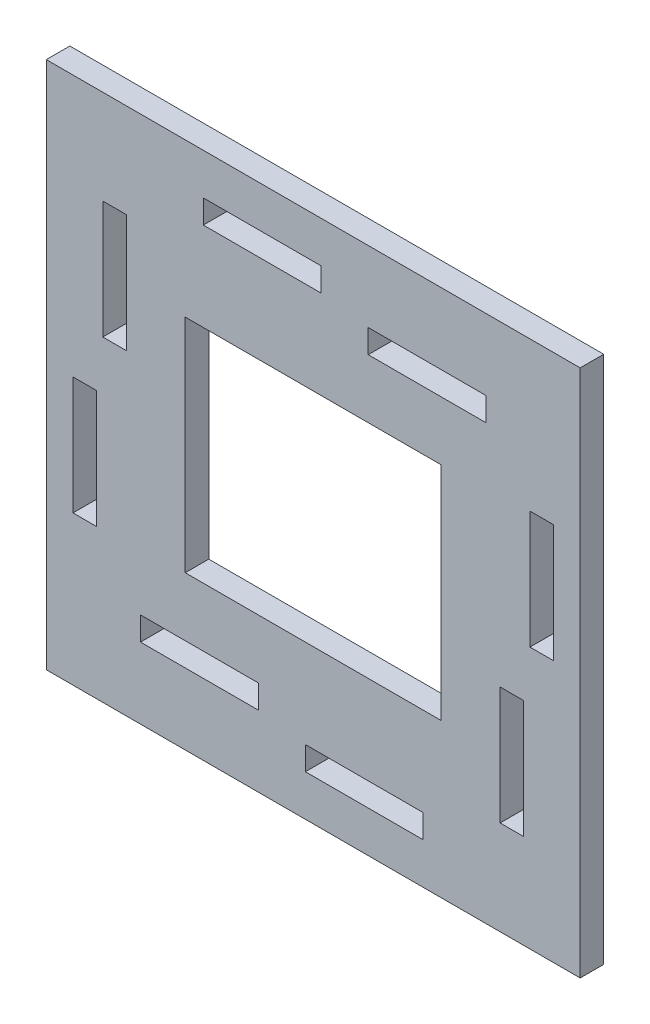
ISO-10303-21;
HEADER;
FILE_DESCRIPTION(('STEP AP214'),'2;1');
FILE_NAME('part.step','',(''),(''),'','','');
FILE_SCHEMA(('AUTOMOTIVE_DESIGN { 1 0 10303 214 1 1 1 1 }'));
ENDSEC;
DATA;
#1=APPLICATION_CONTEXT('core data for automotive mechanical design processes');
#2=APPLICATION_PROTOCOL_DEFINITION('international standard','automotive_design',2000,#1);
#3=PRODUCT_CONTEXT('',#1,'mechanical');
#4=PRODUCT('Part','Part','',(#3));
#5=PRODUCT_RELATED_PRODUCT_CATEGORY('part','',(#4));
#6=PRODUCT_DEFINITION_FORMATION('','',#4);
#7=PRODUCT_DEFINITION_CONTEXT('part definition',#1,'design');
#8=PRODUCT_DEFINITION('design','',#6,#7);
#9=PRODUCT_DEFINITION_SHAPE('','',#8);
#10=(LENGTH_UNIT() NAMED_UNIT(*) SI_UNIT(.MILLI.,.METRE.));
#11=(NAMED_UNIT(*) PLANE_ANGLE_UNIT() SI_UNIT($,.RADIAN.));
#12=(NAMED_UNIT(*) SI_UNIT($,.STERADIAN.) SOLID_ANGLE_UNIT());
#13=UNCERTAINTY_MEASURE_WITH_UNIT(LENGTH_MEASURE(1.E-05),#10,'distance_accuracy_value','');
#14=(GEOMETRIC_REPRESENTATION_CONTEXT(3) GLOBAL_UNCERTAINTY_ASSIGNED_CONTEXT((#13)) GLOBAL_UNIT_ASSIGNED_CONTEXT((#10,
#11,#12)) REPRESENTATION_CONTEXT('',''));
#15=CARTESIAN_POINT('',(0.,0.,0.));
#16=DIRECTION('',(0.,0.,1.));
#17=DIRECTION('',(1.,0.,0.));
#18=AXIS2_PLACEMENT_3D('',#15,#16,#17);
#19=CARTESIAN_POINT('',(0.,0.,3.));
#20=DIRECTION('',(0.,0.,-1.));
#21=DIRECTION('',(-1.,0.,0.));
#22=AXIS2_PLACEMENT_3D('',#19,#20,#21);
#23=PLANE('',#22);
#24=DIRECTION('',(0.,1.,0.));
#25=VECTOR('',#24,1.);
#26=CARTESIAN_POINT('',(-27.6,0.35,3.));
#27=LINE('',#26,#25);
#28=CARTESIAN_POINT('',(-27.6,-14.65,3.));
#29=VERTEX_POINT('',#28);
#30=CARTESIAN_POINT('',(-27.6,0.35,3.));
#31=VERTEX_POINT('',#30);
#32=EDGE_CURVE('E349',#29,#31,#27,.T.);
#33=ORIENTED_EDGE('',*,*,#32,.F.);
#34=DIRECTION('',(1.,0.,0.));
#35=VECTOR('',#34,1.);
#36=CARTESIAN_POINT('',(-30.6,-14.65,3.));
#37=LINE('',#36,#35);
#38=CARTESIAN_POINT('',(-30.6,-14.65,3.));
#39=VERTEX_POINT('',#38);
#40=EDGE_CURVE('E360',#39,#29,#37,.T.);
#41=ORIENTED_EDGE('',*,*,#40,.F.);
#42=DIRECTION('',(0.,-1.,0.));
#43=VECTOR('',#42,1.);
#44=CARTESIAN_POINT('',(-30.6,0.35,3.));
#45=LINE('',#44,#43);
#46=CARTESIAN_POINT('',(-30.6,0.35,3.));
#47=VERTEX_POINT('',#46);
#48=EDGE_CURVE('E356',#47,#39,#45,.T.);
#49=ORIENTED_EDGE('',*,*,#48,.F.);
#50=DIRECTION('',(-1.,0.,0.));
#51=VECTOR('',#50,1.);
#52=CARTESIAN_POINT('',(-30.6,0.35,3.));
#53=LINE('',#52,#51);
#54=EDGE_CURVE('E352',#31,#47,#53,.T.);
#55=ORIENTED_EDGE('',*,*,#54,.F.);
#56=EDGE_LOOP('',(#33,#41,#49,#55));
#57=FACE_BOUND('',#56,.T.);
#58=DIRECTION('',(0.,-1.,0.));
#59=VECTOR('',#58,1.);
#60=CARTESIAN_POINT('',(-0.999999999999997,-25.4,3.));
#61=LINE('',#60,#59);
#62=CARTESIAN_POINT('',(-0.999999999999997,-25.4,3.));
#63=VERTEX_POINT('',#62);
#64=CARTESIAN_POINT('',(-0.999999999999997,-28.4,3.));
#65=VERTEX_POINT('',#64);
#66=EDGE_CURVE('E435',#63,#65,#61,.T.);
#67=ORIENTED_EDGE('',*,*,#66,.F.);
#68=DIRECTION('',(-1.,0.,0.));
#69=VECTOR('',#68,1.);
#70=CARTESIAN_POINT('',(14.,-25.4,3.));
#71=LINE('',#70,#69);
#72=CARTESIAN_POINT('',(14.,-25.4,3.));
#73=VERTEX_POINT('',#72);
#74=EDGE_CURVE('E446',#73,#63,#71,.T.);
#75=ORIENTED_EDGE('',*,*,#74,.F.);
#76=DIRECTION('',(0.,1.,0.));
#77=VECTOR('',#76,1.);
#78=CARTESIAN_POINT('',(14.,-25.4,3.));
#79=LINE('',#78,#77);
#80=CARTESIAN_POINT('',(14.,-28.4,3.));
#81=VERTEX_POINT('',#80);
#82=EDGE_CURVE('E442',#81,#73,#79,.T.);
#83=ORIENTED_EDGE('',*,*,#82,.F.);
#84=DIRECTION('',(1.,0.,0.));
#85=VECTOR('',#84,1.);
#86=CARTESIAN_POINT('',(14.,-28.4,3.));
#87=LINE('',#86,#85);
#88=EDGE_CURVE('E438',#65,#81,#87,.T.);
#89=ORIENTED_EDGE('',*,*,#88,.F.);
#90=EDGE_LOOP('',(#67,#75,#83,#89));
#91=FACE_BOUND('',#90,.T.);
#92=DIRECTION('',(0.,1.,0.));
#93=VECTOR('',#92,1.);
#94=CARTESIAN_POINT('',(30.6,14.65,3.));
#95=LINE('',#94,#93);
#96=CARTESIAN_POINT('',(30.6,-0.35,3.));
#97=VERTEX_POINT('',#96);
#98=CARTESIAN_POINT('',(30.6,14.65,3.));
#99=VERTEX_POINT('',#98);
#100=EDGE_CURVE('E521',#97,#99,#95,.T.);
#101=ORIENTED_EDGE('',*,*,#100,.F.);
#102=DIRECTION('',(1.,0.,0.));
#103=VECTOR('',#102,1.);
#104=CARTESIAN_POINT('',(27.6,-0.35,3.));
#105=LINE('',#104,#103);
#106=CARTESIAN_POINT('',(27.6,-0.35,3.));
#107=VERTEX_POINT('',#106);
#108=EDGE_CURVE('E532',#107,#97,#105,.T.);
#109=ORIENTED_EDGE('',*,*,#108,.F.);
#110=DIRECTION('',(0.,-1.,0.));
#111=VECTOR('',#110,1.);
#112=CARTESIAN_POINT('',(27.6,14.65,3.));
#113=LINE('',#112,#111);
#114=CARTESIAN_POINT('',(27.6,14.65,3.));
#115=VERTEX_POINT('',#114);
#116=EDGE_CURVE('E528',#115,#107,#113,.T.);
#117=ORIENTED_EDGE('',*,*,#116,.F.);
#118=DIRECTION('',(-1.,0.,0.));
#119=VECTOR('',#118,1.);
#120=CARTESIAN_POINT('',(27.6,14.65,3.));
#121=LINE('',#120,#119);
#122=EDGE_CURVE('E524',#99,#115,#121,.T.);
#123=ORIENTED_EDGE('',*,*,#122,.F.);
#124=EDGE_LOOP('',(#101,#109,#117,#123));
#125=FACE_BOUND('',#124,.T.);
#126=DIRECTION('',(0.,1.,0.));
#127=VECTOR('',#126,1.);
#128=CARTESIAN_POINT('',(22.,21.6,3.));
#129=LINE('',#128,#127);
#130=CARTESIAN_POINT('',(22.,21.6,3.));
#131=VERTEX_POINT('',#130);
#132=CARTESIAN_POINT('',(22.,24.6,3.));
#133=VERTEX_POINT('',#132);
#134=EDGE_CURVE('E607',#131,#133,#129,.T.);
#135=ORIENTED_EDGE('',*,*,#134,.F.);
#136=DIRECTION('',(1.,0.,0.));
#137=VECTOR('',#136,1.);
#138=CARTESIAN_POINT('',(7.,21.6,3.));
#139=LINE('',#138,#137);
#140=CARTESIAN_POINT('',(7.,21.6,3.));
#141=VERTEX_POINT('',#140);
#142=EDGE_CURVE('E618',#141,#131,#139,.T.);
#143=ORIENTED_EDGE('',*,*,#142,.F.);
#144=DIRECTION('',(0.,-1.,0.));
#145=VECTOR('',#144,1.);
#146=CARTESIAN_POINT('',(7.,21.6,3.));
#147=LINE('',#146,#145);
#148=CARTESIAN_POINT('',(7.,24.6,3.));
#149=VERTEX_POINT('',#148);
#150=EDGE_CURVE('E614',#149,#141,#147,.T.);
#151=ORIENTED_EDGE('',*,*,#150,.F.);
#152=DIRECTION('',(-1.,0.,0.));
#153=VECTOR('',#152,1.);
#154=CARTESIAN_POINT('',(7.,24.6,3.));
#155=LINE('',#154,#153);
#156=EDGE_CURVE('E610',#133,#149,#155,.T.);
#157=ORIENTED_EDGE('',*,*,#156,.F.);
#158=EDGE_LOOP('',(#135,#143,#151,#157));
#159=FACE_BOUND('',#158,.T.);
#160=DIRECTION('',(0.,1.,0.));
#161=VECTOR('',#160,1.);
#162=CARTESIAN_POINT('',(34.,-33.65,3.));
#163=LINE('',#162,#161);
#164=CARTESIAN_POINT('',(34.,-33.65,3.));
#165=VERTEX_POINT('',#164);
#166=CARTESIAN_POINT('',(34.,33.65,3.));
#167=VERTEX_POINT('',#166);
#168=EDGE_CURVE('E693',#165,#167,#163,.T.);
#169=ORIENTED_EDGE('',*,*,#168,.T.);
#170=DIRECTION('',(-1.,0.,0.));
#171=VECTOR('',#170,1.);
#172=CARTESIAN_POINT('',(-34.,33.65,3.));
#173=LINE('',#172,#171);
#174=CARTESIAN_POINT('',(-34.,33.65,3.));
#175=VERTEX_POINT('',#174);
#176=EDGE_CURVE('E697',#167,#175,#173,.T.);
#177=ORIENTED_EDGE('',*,*,#176,.T.);
#178=DIRECTION('',(0.,-1.,0.));
#179=VECTOR('',#178,1.);
#180=CARTESIAN_POINT('',(-34.,-33.65,3.));
#181=LINE('',#180,#179);
#182=CARTESIAN_POINT('',(-34.,-33.65,3.));
#183=VERTEX_POINT('',#182);
#184=EDGE_CURVE('E701',#175,#183,#181,.T.);
#185=ORIENTED_EDGE('',*,*,#184,.T.);
#186=DIRECTION('',(1.,0.,0.));
#187=VECTOR('',#186,1.);
#188=CARTESIAN_POINT('',(-34.,-33.65,3.));
#189=LINE('',#188,#187);
#190=EDGE_CURVE('E704',#183,#165,#189,.T.);
#191=ORIENTED_EDGE('',*,*,#190,.T.);
#192=EDGE_LOOP('',(#169,#177,#185,#191));
#193=FACE_BOUND('',#192,.T.);
#194=DIRECTION('',(0.,1.,0.));
#195=VECTOR('',#194,1.);
#196=CARTESIAN_POINT('',(16.3,-14.1,3.));
#197=LINE('',#196,#195);
#198=CARTESIAN_POINT('',(16.3,-14.1,3.));
#199=VERTEX_POINT('',#198);
#200=CARTESIAN_POINT('',(16.3,14.1,3.));
#201=VERTEX_POINT('',#200);
#202=EDGE_CURVE('E650',#199,#201,#197,.T.);
#203=ORIENTED_EDGE('',*,*,#202,.F.);
#204=DIRECTION('',(1.,0.,0.));
#205=VECTOR('',#204,1.);
#206=CARTESIAN_POINT('',(-16.3,-14.1,3.));
#207=LINE('',#206,#205);
#208=CARTESIAN_POINT('',(-16.3,-14.1,3.));
#209=VERTEX_POINT('',#208);
#210=EDGE_CURVE('E661',#209,#199,#207,.T.);
#211=ORIENTED_EDGE('',*,*,#210,.F.);
#212=DIRECTION('',(0.,-1.,0.));
#213=VECTOR('',#212,1.);
#214=CARTESIAN_POINT('',(-16.3,-14.1,3.));
#215=LINE('',#214,#213);
#216=CARTESIAN_POINT('',(-16.3,14.1,3.));
#217=VERTEX_POINT('',#216);
#218=EDGE_CURVE('E657',#217,#209,#215,.T.);
#219=ORIENTED_EDGE('',*,*,#218,.F.);
#220=DIRECTION('',(-1.,0.,0.));
#221=VECTOR('',#220,1.);
#222=CARTESIAN_POINT('',(-16.3,14.1,3.));
#223=LINE('',#222,#221);
#224=EDGE_CURVE('E653',#201,#217,#223,.T.);
#225=ORIENTED_EDGE('',*,*,#224,.F.);
#226=EDGE_LOOP('',(#203,#211,#219,#225));
#227=FACE_BOUND('',#226,.T.);
#228=DIRECTION('',(0.,-1.,0.));
#229=VECTOR('',#228,1.);
#230=CARTESIAN_POINT('',(-14.,25.4,3.));
#231=LINE('',#230,#229);
#232=CARTESIAN_POINT('',(-14.,28.4,3.));
#233=VERTEX_POINT('',#232);
#234=CARTESIAN_POINT('',(-14.,25.4,3.));
#235=VERTEX_POINT('',#234);
#236=EDGE_CURVE('E564',#233,#235,#231,.T.);
#237=ORIENTED_EDGE('',*,*,#236,.F.);
#238=DIRECTION('',(-1.,0.,0.));
#239=VECTOR('',#238,1.);
#240=CARTESIAN_POINT('',(0.999999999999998,28.4,3.));
#241=LINE('',#240,#239);
#242=CARTESIAN_POINT('',(0.999999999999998,28.4,3.));
#243=VERTEX_POINT('',#242);
#244=EDGE_CURVE('E575',#243,#233,#241,.T.);
#245=ORIENTED_EDGE('',*,*,#244,.F.);
#246=DIRECTION('',(0.,1.,0.));
#247=VECTOR('',#246,1.);
#248=CARTESIAN_POINT('',(0.999999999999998,25.4,3.));
#249=LINE('',#248,#247);
#250=CARTESIAN_POINT('',(0.999999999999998,25.4,3.));
#251=VERTEX_POINT('',#250);
#252=EDGE_CURVE('E571',#251,#243,#249,.T.);
#253=ORIENTED_EDGE('',*,*,#252,.F.);
#254=DIRECTION('',(1.,0.,0.));
#255=VECTOR('',#254,1.);
#256=CARTESIAN_POINT('',(0.999999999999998,25.4,3.));
#257=LINE('',#256,#255);
#258=EDGE_CURVE('E567',#235,#251,#257,.T.);
#259=ORIENTED_EDGE('',*,*,#258,.F.);
#260=EDGE_LOOP('',(#237,#245,#253,#259));
#261=FACE_BOUND('',#260,.T.);
#262=DIRECTION('',(0.,1.,0.));
#263=VECTOR('',#262,1.);
#264=CARTESIAN_POINT('',(26.8,-6.65,3.));
#265=LINE('',#264,#263);
#266=CARTESIAN_POINT('',(26.8,-21.65,3.));
#267=VERTEX_POINT('',#266);
#268=CARTESIAN_POINT('',(26.8,-6.65,3.));
#269=VERTEX_POINT('',#268);
#270=EDGE_CURVE('E478',#267,#269,#265,.T.);
#271=ORIENTED_EDGE('',*,*,#270,.F.);
#272=DIRECTION('',(1.,0.,0.));
#273=VECTOR('',#272,1.);
#274=CARTESIAN_POINT('',(23.8,-21.65,3.));
#275=LINE('',#274,#273);
#276=CARTESIAN_POINT('',(23.8,-21.65,3.));
#277=VERTEX_POINT('',#276);
#278=EDGE_CURVE('E489',#277,#267,#275,.T.);
#279=ORIENTED_EDGE('',*,*,#278,.F.);
#280=DIRECTION('',(0.,-1.,0.));
#281=VECTOR('',#280,1.);
#282=CARTESIAN_POINT('',(23.8,-6.65,3.));
#283=LINE('',#282,#281);
#284=CARTESIAN_POINT('',(23.8,-6.65,3.));
#285=VERTEX_POINT('',#284);
#286=EDGE_CURVE('E485',#285,#277,#283,.T.);
#287=ORIENTED_EDGE('',*,*,#286,.F.);
#288=DIRECTION('',(-1.,0.,0.));
#289=VECTOR('',#288,1.);
#290=CARTESIAN_POINT('',(23.8,-6.65,3.));
#291=LINE('',#290,#289);
#292=EDGE_CURVE('E481',#269,#285,#291,.T.);
#293=ORIENTED_EDGE('',*,*,#292,.F.);
#294=EDGE_LOOP('',(#271,#279,#287,#293));
#295=FACE_BOUND('',#294,.T.);
#296=DIRECTION('',(0.,-1.,0.));
#297=VECTOR('',#296,1.);
#298=CARTESIAN_POINT('',(-22.,-21.6,3.));
#299=LINE('',#298,#297);
#300=CARTESIAN_POINT('',(-22.,-21.6,3.));
#301=VERTEX_POINT('',#300);
#302=CARTESIAN_POINT('',(-22.,-24.6,3.));
#303=VERTEX_POINT('',#302);
#304=EDGE_CURVE('E392',#301,#303,#299,.T.);
#305=ORIENTED_EDGE('',*,*,#304,.F.);
#306=DIRECTION('',(-1.,0.,0.));
#307=VECTOR('',#306,1.);
#308=CARTESIAN_POINT('',(-7.,-21.6,3.));
#309=LINE('',#308,#307);
#310=CARTESIAN_POINT('',(-7.,-21.6,3.));
#311=VERTEX_POINT('',#310);
#312=EDGE_CURVE('E403',#311,#301,#309,.T.);
#313=ORIENTED_EDGE('',*,*,#312,.F.);
#314=DIRECTION('',(0.,1.,0.));
#315=VECTOR('',#314,1.);
#316=CARTESIAN_POINT('',(-7.,-21.6,3.));
#317=LINE('',#316,#315);
#318=CARTESIAN_POINT('',(-7.,-24.6,3.));
#319=VERTEX_POINT('',#318);
#320=EDGE_CURVE('E399',#319,#311,#317,.T.);
#321=ORIENTED_EDGE('',*,*,#320,.F.);
#322=DIRECTION('',(1.,0.,0.));
#323=VECTOR('',#322,1.);
#324=CARTESIAN_POINT('',(-7.,-24.6,3.));
#325=LINE('',#324,#323);
#326=EDGE_CURVE('E395',#303,#319,#325,.T.);
#327=ORIENTED_EDGE('',*,*,#326,.F.);
#328=EDGE_LOOP('',(#305,#313,#321,#327));
#329=FACE_BOUND('',#328,.T.);
#330=DIRECTION('',(0.,-1.,0.));
#331=VECTOR('',#330,1.);
#332=CARTESIAN_POINT('',(-26.8,21.65,3.));
#333=LINE('',#332,#331);
#334=CARTESIAN_POINT('',(-26.8,21.65,3.));
#335=VERTEX_POINT('',#334);
#336=CARTESIAN_POINT('',(-26.8,6.65,3.));
#337=VERTEX_POINT('',#336);
#338=EDGE_CURVE('E301',#335,#337,#333,.T.);
#339=ORIENTED_EDGE('',*,*,#338,.F.);
#340=DIRECTION('',(-1.,0.,0.));
#341=VECTOR('',#340,1.);
#342=CARTESIAN_POINT('',(-23.8,21.65,3.));
#343=LINE('',#342,#341);
#344=CARTESIAN_POINT('',(-23.8,21.65,3.));
#345=VERTEX_POINT('',#344);
#346=EDGE_CURVE('E327',#345,#335,#343,.T.);
#347=ORIENTED_EDGE('',*,*,#346,.F.);
#348=DIRECTION('',(0.,1.,0.));
#349=VECTOR('',#348,1.);
#350=CARTESIAN_POINT('',(-23.8,21.65,3.));
#351=LINE('',#350,#349);
#352=CARTESIAN_POINT('',(-23.8,6.65,3.));
#353=VERTEX_POINT('',#352);
#354=EDGE_CURVE('E323',#353,#345,#351,.T.);
#355=ORIENTED_EDGE('',*,*,#354,.F.);
#356=DIRECTION('',(1.,0.,0.));
#357=VECTOR('',#356,1.);
#358=CARTESIAN_POINT('',(-23.8,6.65,3.));
#359=LINE('',#358,#357);
#360=EDGE_CURVE('E310',#337,#353,#359,.T.);
#361=ORIENTED_EDGE('',*,*,#360,.F.);
#362=EDGE_LOOP('',(#339,#347,#355,#361));
#363=FACE_BOUND('',#362,.T.);
#364=ADVANCED_FACE('F43',(#57,#91,#125,#159,#193,#227,#261,#295,#329,#363),#23,.F.);
#365=CARTESIAN_POINT('',(0.,0.,0.));
#366=DIRECTION('',(0.,0.,-1.));
#367=DIRECTION('',(-1.,0.,0.));
#368=AXIS2_PLACEMENT_3D('',#365,#366,#367);
#369=PLANE('',#368);
#370=DIRECTION('',(0.,1.,0.));
#371=VECTOR('',#370,1.);
#372=CARTESIAN_POINT('',(34.,-33.65,0.));
#373=LINE('',#372,#371);
#374=CARTESIAN_POINT('',(34.,-33.65,0.));
#375=VERTEX_POINT('',#374);
#376=CARTESIAN_POINT('',(34.,33.65,0.));
#377=VERTEX_POINT('',#376);
#378=EDGE_CURVE('E692',#375,#377,#373,.T.);
#379=ORIENTED_EDGE('',*,*,#378,.F.);
#380=DIRECTION('',(1.,0.,0.));
#381=VECTOR('',#380,1.);
#382=CARTESIAN_POINT('',(-34.,-33.65,0.));
#383=LINE('',#382,#381);
#384=CARTESIAN_POINT('',(-34.,-33.65,0.));
#385=VERTEX_POINT('',#384);
#386=EDGE_CURVE('E698',#385,#375,#383,.T.);
#387=ORIENTED_EDGE('',*,*,#386,.F.);
#388=DIRECTION('',(0.,-1.,0.));
#389=VECTOR('',#388,1.);
#390=CARTESIAN_POINT('',(-34.,-33.65,0.));
#391=LINE('',#390,#389);
#392=CARTESIAN_POINT('',(-34.,33.65,0.));
#393=VERTEX_POINT('',#392);
#394=EDGE_CURVE('E714',#393,#385,#391,.T.);
#395=ORIENTED_EDGE('',*,*,#394,.F.);
#396=DIRECTION('',(-1.,0.,0.));
#397=VECTOR('',#396,1.);
#398=CARTESIAN_POINT('',(-34.,33.65,0.));
#399=LINE('',#398,#397);
#400=EDGE_CURVE('E711',#377,#393,#399,.T.);
#401=ORIENTED_EDGE('',*,*,#400,.F.);
#402=EDGE_LOOP('',(#379,#387,#395,#401));
#403=FACE_BOUND('',#402,.T.);
#404=DIRECTION('',(1.,0.,0.));
#405=VECTOR('',#404,1.);
#406=CARTESIAN_POINT('',(-16.3,-14.1,0.));
#407=LINE('',#406,#405);
#408=CARTESIAN_POINT('',(-16.3,-14.1,0.));
#409=VERTEX_POINT('',#408);
#410=CARTESIAN_POINT('',(16.3,-14.1,0.));
#411=VERTEX_POINT('',#410);
#412=EDGE_CURVE('E654',#409,#411,#407,.T.);
#413=ORIENTED_EDGE('',*,*,#412,.T.);
#414=DIRECTION('',(0.,1.,0.));
#415=VECTOR('',#414,1.);
#416=CARTESIAN_POINT('',(16.3,-14.1,0.));
#417=LINE('',#416,#415);
#418=CARTESIAN_POINT('',(16.3,14.1,0.));
#419=VERTEX_POINT('',#418);
#420=EDGE_CURVE('E649',#411,#419,#417,.T.);
#421=ORIENTED_EDGE('',*,*,#420,.T.);
#422=DIRECTION('',(-1.,0.,0.));
#423=VECTOR('',#422,1.);
#424=CARTESIAN_POINT('',(-16.3,14.1,0.));
#425=LINE('',#424,#423);
#426=CARTESIAN_POINT('',(-16.3,14.1,0.));
#427=VERTEX_POINT('',#426);
#428=EDGE_CURVE('E668',#419,#427,#425,.T.);
#429=ORIENTED_EDGE('',*,*,#428,.T.);
#430=DIRECTION('',(0.,-1.,0.));
#431=VECTOR('',#430,1.);
#432=CARTESIAN_POINT('',(-16.3,-14.1,0.));
#433=LINE('',#432,#431);
#434=EDGE_CURVE('E672',#427,#409,#433,.T.);
#435=ORIENTED_EDGE('',*,*,#434,.T.);
#436=EDGE_LOOP('',(#413,#421,#429,#435));
#437=FACE_BOUND('',#436,.T.);
#438=DIRECTION('',(1.,0.,0.));
#439=VECTOR('',#438,1.);
#440=CARTESIAN_POINT('',(7.,21.6,0.));
#441=LINE('',#440,#439);
#442=CARTESIAN_POINT('',(7.,21.6,0.));
#443=VERTEX_POINT('',#442);
#444=CARTESIAN_POINT('',(22.,21.6,0.));
#445=VERTEX_POINT('',#444);
#446=EDGE_CURVE('E611',#443,#445,#441,.T.);
#447=ORIENTED_EDGE('',*,*,#446,.T.);
#448=DIRECTION('',(0.,1.,0.));
#449=VECTOR('',#448,1.);
#450=CARTESIAN_POINT('',(22.,21.6,0.));
#451=LINE('',#450,#449);
#452=CARTESIAN_POINT('',(22.,24.6,0.));
#453=VERTEX_POINT('',#452);
#454=EDGE_CURVE('E606',#445,#453,#451,.T.);
#455=ORIENTED_EDGE('',*,*,#454,.T.);
#456=DIRECTION('',(-1.,0.,0.));
#457=VECTOR('',#456,1.);
#458=CARTESIAN_POINT('',(7.,24.6,0.));
#459=LINE('',#458,#457);
#460=CARTESIAN_POINT('',(7.,24.6,0.));
#461=VERTEX_POINT('',#460);
#462=EDGE_CURVE('E625',#453,#461,#459,.T.);
#463=ORIENTED_EDGE('',*,*,#462,.T.);
#464=DIRECTION('',(0.,-1.,0.));
#465=VECTOR('',#464,1.);
#466=CARTESIAN_POINT('',(7.,21.6,0.));
#467=LINE('',#466,#465);
#468=EDGE_CURVE('E629',#461,#443,#467,.T.);
#469=ORIENTED_EDGE('',*,*,#468,.T.);
#470=EDGE_LOOP('',(#447,#455,#463,#469));
#471=FACE_BOUND('',#470,.T.);
#472=DIRECTION('',(-1.,0.,0.));
#473=VECTOR('',#472,1.);
#474=CARTESIAN_POINT('',(0.999999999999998,28.4,0.));
#475=LINE('',#474,#473);
#476=CARTESIAN_POINT('',(0.999999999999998,28.4,0.));
#477=VERTEX_POINT('',#476);
#478=CARTESIAN_POINT('',(-14.,28.4,0.));
#479=VERTEX_POINT('',#478);
#480=EDGE_CURVE('E568',#477,#479,#475,.T.);
#481=ORIENTED_EDGE('',*,*,#480,.T.);
#482=DIRECTION('',(0.,-1.,0.));
#483=VECTOR('',#482,1.);
#484=CARTESIAN_POINT('',(-14.,25.4,0.));
#485=LINE('',#484,#483);
#486=CARTESIAN_POINT('',(-14.,25.4,0.));
#487=VERTEX_POINT('',#486);
#488=EDGE_CURVE('E563',#479,#487,#485,.T.);
#489=ORIENTED_EDGE('',*,*,#488,.T.);
#490=DIRECTION('',(1.,0.,0.));
#491=VECTOR('',#490,1.);
#492=CARTESIAN_POINT('',(0.999999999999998,25.4,0.));
#493=LINE('',#492,#491);
#494=CARTESIAN_POINT('',(0.999999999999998,25.4,0.));
#495=VERTEX_POINT('',#494);
#496=EDGE_CURVE('E582',#487,#495,#493,.T.);
#497=ORIENTED_EDGE('',*,*,#496,.T.);
#498=DIRECTION('',(0.,1.,0.));
#499=VECTOR('',#498,1.);
#500=CARTESIAN_POINT('',(0.999999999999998,25.4,0.));
#501=LINE('',#500,#499);
#502=EDGE_CURVE('E586',#495,#477,#501,.T.);
#503=ORIENTED_EDGE('',*,*,#502,.T.);
#504=EDGE_LOOP('',(#481,#489,#497,#503));
#505=FACE_BOUND('',#504,.T.);
#506=DIRECTION('',(1.,0.,0.));
#507=VECTOR('',#506,1.);
#508=CARTESIAN_POINT('',(27.6,-0.35,0.));
#509=LINE('',#508,#507);
#510=CARTESIAN_POINT('',(27.6,-0.35,0.));
#511=VERTEX_POINT('',#510);
#512=CARTESIAN_POINT('',(30.6,-0.35,0.));
#513=VERTEX_POINT('',#512);
#514=EDGE_CURVE('E525',#511,#513,#509,.T.);
#515=ORIENTED_EDGE('',*,*,#514,.T.);
#516=DIRECTION('',(0.,1.,0.));
#517=VECTOR('',#516,1.);
#518=CARTESIAN_POINT('',(30.6,14.65,0.));
#519=LINE('',#518,#517);
#520=CARTESIAN_POINT('',(30.6,14.65,0.));
#521=VERTEX_POINT('',#520);
#522=EDGE_CURVE('E520',#513,#521,#519,.T.);
#523=ORIENTED_EDGE('',*,*,#522,.T.);
#524=DIRECTION('',(-1.,0.,0.));
#525=VECTOR('',#524,1.);
#526=CARTESIAN_POINT('',(27.6,14.65,0.));
#527=LINE('',#526,#525);
#528=CARTESIAN_POINT('',(27.6,14.65,0.));
#529=VERTEX_POINT('',#528);
#530=EDGE_CURVE('E539',#521,#529,#527,.T.);
#531=ORIENTED_EDGE('',*,*,#530,.T.);
#532=DIRECTION('',(0.,-1.,0.));
#533=VECTOR('',#532,1.);
#534=CARTESIAN_POINT('',(27.6,14.65,0.));
#535=LINE('',#534,#533);
#536=EDGE_CURVE('E543',#529,#511,#535,.T.);
#537=ORIENTED_EDGE('',*,*,#536,.T.);
#538=EDGE_LOOP('',(#515,#523,#531,#537));
#539=FACE_BOUND('',#538,.T.);
#540=DIRECTION('',(1.,0.,0.));
#541=VECTOR('',#540,1.);
#542=CARTESIAN_POINT('',(23.8,-21.65,0.));
#543=LINE('',#542,#541);
#544=CARTESIAN_POINT('',(23.8,-21.65,0.));
#545=VERTEX_POINT('',#544);
#546=CARTESIAN_POINT('',(26.8,-21.65,0.));
#547=VERTEX_POINT('',#546);
#548=EDGE_CURVE('E482',#545,#547,#543,.T.);
#549=ORIENTED_EDGE('',*,*,#548,.T.);
#550=DIRECTION('',(0.,1.,0.));
#551=VECTOR('',#550,1.);
#552=CARTESIAN_POINT('',(26.8,-6.65,0.));
#553=LINE('',#552,#551);
#554=CARTESIAN_POINT('',(26.8,-6.65,0.));
#555=VERTEX_POINT('',#554);
#556=EDGE_CURVE('E477',#547,#555,#553,.T.);
#557=ORIENTED_EDGE('',*,*,#556,.T.);
#558=DIRECTION('',(-1.,0.,0.));
#559=VECTOR('',#558,1.);
#560=CARTESIAN_POINT('',(23.8,-6.65,0.));
#561=LINE('',#560,#559);
#562=CARTESIAN_POINT('',(23.8,-6.65,0.));
#563=VERTEX_POINT('',#562);
#564=EDGE_CURVE('E496',#555,#563,#561,.T.);
#565=ORIENTED_EDGE('',*,*,#564,.T.);
#566=DIRECTION('',(0.,-1.,0.));
#567=VECTOR('',#566,1.);
#568=CARTESIAN_POINT('',(23.8,-6.65,0.));
#569=LINE('',#568,#567);
#570=EDGE_CURVE('E500',#563,#545,#569,.T.);
#571=ORIENTED_EDGE('',*,*,#570,.T.);
#572=EDGE_LOOP('',(#549,#557,#565,#571));
#573=FACE_BOUND('',#572,.T.);
#574=DIRECTION('',(-1.,0.,0.));
#575=VECTOR('',#574,1.);
#576=CARTESIAN_POINT('',(14.,-25.4,0.));
#577=LINE('',#576,#575);
#578=CARTESIAN_POINT('',(14.,-25.4,0.));
#579=VERTEX_POINT('',#578);
#580=CARTESIAN_POINT('',(-0.999999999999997,-25.4,0.));
#581=VERTEX_POINT('',#580);
#582=EDGE_CURVE('E439',#579,#581,#577,.T.);
#583=ORIENTED_EDGE('',*,*,#582,.T.);
#584=DIRECTION('',(0.,-1.,0.));
#585=VECTOR('',#584,1.);
#586=CARTESIAN_POINT('',(-0.999999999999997,-25.4,0.));
#587=LINE('',#586,#585);
#588=CARTESIAN_POINT('',(-0.999999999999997,-28.4,0.));
#589=VERTEX_POINT('',#588);
#590=EDGE_CURVE('E434',#581,#589,#587,.T.);
#591=ORIENTED_EDGE('',*,*,#590,.T.);
#592=DIRECTION('',(1.,0.,0.));
#593=VECTOR('',#592,1.);
#594=CARTESIAN_POINT('',(14.,-28.4,0.));
#595=LINE('',#594,#593);
#596=CARTESIAN_POINT('',(14.,-28.4,0.));
#597=VERTEX_POINT('',#596);
#598=EDGE_CURVE('E453',#589,#597,#595,.T.);
#599=ORIENTED_EDGE('',*,*,#598,.T.);
#600=DIRECTION('',(0.,1.,0.));
#601=VECTOR('',#600,1.);
#602=CARTESIAN_POINT('',(14.,-25.4,0.));
#603=LINE('',#602,#601);
#604=EDGE_CURVE('E457',#597,#579,#603,.T.);
#605=ORIENTED_EDGE('',*,*,#604,.T.);
#606=EDGE_LOOP('',(#583,#591,#599,#605));
#607=FACE_BOUND('',#606,.T.);
#608=DIRECTION('',(-1.,0.,0.));
#609=VECTOR('',#608,1.);
#610=CARTESIAN_POINT('',(-7.,-21.6,0.));
#611=LINE('',#610,#609);
#612=CARTESIAN_POINT('',(-7.,-21.6,0.));
#613=VERTEX_POINT('',#612);
#614=CARTESIAN_POINT('',(-22.,-21.6,0.));
#615=VERTEX_POINT('',#614);
#616=EDGE_CURVE('E396',#613,#615,#611,.T.);
#617=ORIENTED_EDGE('',*,*,#616,.T.);
#618=DIRECTION('',(0.,-1.,0.));
#619=VECTOR('',#618,1.);
#620=CARTESIAN_POINT('',(-22.,-21.6,0.));
#621=LINE('',#620,#619);
#622=CARTESIAN_POINT('',(-22.,-24.6,0.));
#623=VERTEX_POINT('',#622);
#624=EDGE_CURVE('E391',#615,#623,#621,.T.);
#625=ORIENTED_EDGE('',*,*,#624,.T.);
#626=DIRECTION('',(1.,0.,0.));
#627=VECTOR('',#626,1.);
#628=CARTESIAN_POINT('',(-7.,-24.6,0.));
#629=LINE('',#628,#627);
#630=CARTESIAN_POINT('',(-7.,-24.6,0.));
#631=VERTEX_POINT('',#630);
#632=EDGE_CURVE('E410',#623,#631,#629,.T.);
#633=ORIENTED_EDGE('',*,*,#632,.T.);
#634=DIRECTION('',(0.,1.,0.));
#635=VECTOR('',#634,1.);
#636=CARTESIAN_POINT('',(-7.,-21.6,0.));
#637=LINE('',#636,#635);
#638=EDGE_CURVE('E414',#631,#613,#637,.T.);
#639=ORIENTED_EDGE('',*,*,#638,.T.);
#640=EDGE_LOOP('',(#617,#625,#633,#639));
#641=FACE_BOUND('',#640,.T.);
#642=DIRECTION('',(1.,0.,0.));
#643=VECTOR('',#642,1.);
#644=CARTESIAN_POINT('',(-30.6,-14.65,0.));
#645=LINE('',#644,#643);
#646=CARTESIAN_POINT('',(-30.6,-14.65,0.));
#647=VERTEX_POINT('',#646);
#648=CARTESIAN_POINT('',(-27.6,-14.65,0.));
#649=VERTEX_POINT('',#648);
#650=EDGE_CURVE('E353',#647,#649,#645,.T.);
#651=ORIENTED_EDGE('',*,*,#650,.T.);
#652=DIRECTION('',(0.,1.,0.));
#653=VECTOR('',#652,1.);
#654=CARTESIAN_POINT('',(-27.6,0.35,0.));
#655=LINE('',#654,#653);
#656=CARTESIAN_POINT('',(-27.6,0.35,0.));
#657=VERTEX_POINT('',#656);
#658=EDGE_CURVE('E319',#649,#657,#655,.T.);
#659=ORIENTED_EDGE('',*,*,#658,.T.);
#660=DIRECTION('',(-1.,0.,0.));
#661=VECTOR('',#660,1.);
#662=CARTESIAN_POINT('',(-30.6,0.35,0.));
#663=LINE('',#662,#661);
#664=CARTESIAN_POINT('',(-30.6,0.35,0.));
#665=VERTEX_POINT('',#664);
#666=EDGE_CURVE('E367',#657,#665,#663,.T.);
#667=ORIENTED_EDGE('',*,*,#666,.T.);
#668=DIRECTION('',(0.,-1.,0.));
#669=VECTOR('',#668,1.);
#670=CARTESIAN_POINT('',(-30.6,0.35,0.));
#671=LINE('',#670,#669);
#672=EDGE_CURVE('E371',#665,#647,#671,.T.);
#673=ORIENTED_EDGE('',*,*,#672,.T.);
#674=EDGE_LOOP('',(#651,#659,#667,#673));
#675=FACE_BOUND('',#674,.T.);
#676=DIRECTION('',(-1.,0.,0.));
#677=VECTOR('',#676,1.);
#678=CARTESIAN_POINT('',(-23.8,21.65,0.));
#679=LINE('',#678,#677);
#680=CARTESIAN_POINT('',(-23.8,21.65,0.));
#681=VERTEX_POINT('',#680);
#682=CARTESIAN_POINT('',(-26.8,21.65,0.));
#683=VERTEX_POINT('',#682);
#684=EDGE_CURVE('E311',#681,#683,#679,.T.);
#685=ORIENTED_EDGE('',*,*,#684,.T.);
#686=DIRECTION('',(0.,-1.,0.));
#687=VECTOR('',#686,1.);
#688=CARTESIAN_POINT('',(-26.8,21.65,0.));
#689=LINE('',#688,#687);
#690=CARTESIAN_POINT('',(-26.8,6.65,0.));
#691=VERTEX_POINT('',#690);
#692=EDGE_CURVE('E67',#683,#691,#689,.T.);
#693=ORIENTED_EDGE('',*,*,#692,.T.);
#694=DIRECTION('',(1.,0.,0.));
#695=VECTOR('',#694,1.);
#696=CARTESIAN_POINT('',(-23.8,6.65,0.));
#697=LINE('',#696,#695);
#698=CARTESIAN_POINT('',(-23.8,6.65,0.));
#699=VERTEX_POINT('',#698);
#700=EDGE_CURVE('E317',#691,#699,#697,.T.);
#701=ORIENTED_EDGE('',*,*,#700,.T.);
#702=DIRECTION('',(0.,1.,0.));
#703=VECTOR('',#702,1.);
#704=CARTESIAN_POINT('',(-23.8,21.65,0.));
#705=LINE('',#704,#703);
#706=EDGE_CURVE('E336',#699,#681,#705,.T.);
#707=ORIENTED_EDGE('',*,*,#706,.T.);
#708=EDGE_LOOP('',(#685,#693,#701,#707));
#709=FACE_BOUND('',#708,.T.);
#710=ADVANCED_FACE('F737',(#403,#437,#471,#505,#539,#573,#607,#641,#675,#709),#369,.T.);
#711=CARTESIAN_POINT('',(34.,-33.65,3.));
#712=DIRECTION('',(-1.,0.,0.));
#713=DIRECTION('',(0.,0.,1.));
#714=AXIS2_PLACEMENT_3D('',#711,#712,#713);
#715=PLANE('',#714);
#716=ORIENTED_EDGE('',*,*,#378,.T.);
#717=DIRECTION('',(0.,0.,-1.));
#718=VECTOR('',#717,1.);
#719=CARTESIAN_POINT('',(34.,33.65,3.));
#720=LINE('',#719,#718);
#721=EDGE_CURVE('E11',#167,#377,#720,.T.);
#722=ORIENTED_EDGE('',*,*,#721,.F.);
#723=ORIENTED_EDGE('',*,*,#168,.F.);
#724=DIRECTION('',(0.,0.,-1.));
#725=VECTOR('',#724,1.);
#726=CARTESIAN_POINT('',(34.,-33.65,3.));
#727=LINE('',#726,#725);
#728=EDGE_CURVE('E707',#165,#375,#727,.T.);
#729=ORIENTED_EDGE('',*,*,#728,.T.);
#730=EDGE_LOOP('',(#716,#722,#723,#729));
#731=FACE_BOUND('',#730,.T.);
#732=ADVANCED_FACE('F45',(#731),#715,.F.);
#733=CARTESIAN_POINT('',(-34.,33.65,3.));
#734=DIRECTION('',(0.,-1.,0.));
#735=DIRECTION('',(0.,0.,-1.));
#736=AXIS2_PLACEMENT_3D('',#733,#734,#735);
#737=PLANE('',#736);
#738=ORIENTED_EDGE('',*,*,#400,.T.);
#739=DIRECTION('',(0.,0.,-1.));
#740=VECTOR('',#739,1.);
#741=CARTESIAN_POINT('',(-34.,33.65,3.));
#742=LINE('',#741,#740);
#743=EDGE_CURVE('E52',#175,#393,#742,.T.);
#744=ORIENTED_EDGE('',*,*,#743,.F.);
#745=ORIENTED_EDGE('',*,*,#176,.F.);
#746=ORIENTED_EDGE('',*,*,#721,.T.);
#747=EDGE_LOOP('',(#738,#744,#745,#746));
#748=FACE_BOUND('',#747,.T.);
#749=ADVANCED_FACE('F748',(#748),#737,.F.);
#750=CARTESIAN_POINT('',(-34.,-33.65,3.));
#751=DIRECTION('',(1.,0.,0.));
#752=DIRECTION('',(0.,0.,-1.));
#753=AXIS2_PLACEMENT_3D('',#750,#751,#752);
#754=PLANE('',#753);
#755=ORIENTED_EDGE('',*,*,#394,.T.);
#756=DIRECTION('',(0.,0.,-1.));
#757=VECTOR('',#756,1.);
#758=CARTESIAN_POINT('',(-34.,-33.65,3.));
#759=LINE('',#758,#757);
#760=EDGE_CURVE('E722',#183,#385,#759,.T.);
#761=ORIENTED_EDGE('',*,*,#760,.F.);
#762=ORIENTED_EDGE('',*,*,#184,.F.);
#763=ORIENTED_EDGE('',*,*,#743,.T.);
#764=EDGE_LOOP('',(#755,#761,#762,#763));
#765=FACE_BOUND('',#764,.T.);
#766=ADVANCED_FACE('F731',(#765),#754,.F.);
#767=CARTESIAN_POINT('',(-34.,-33.65,3.));
#768=DIRECTION('',(0.,1.,0.));
#769=DIRECTION('',(0.,0.,1.));
#770=AXIS2_PLACEMENT_3D('',#767,#768,#769);
#771=PLANE('',#770);
#772=ORIENTED_EDGE('',*,*,#386,.T.);
#773=ORIENTED_EDGE('',*,*,#728,.F.);
#774=ORIENTED_EDGE('',*,*,#190,.F.);
#775=ORIENTED_EDGE('',*,*,#760,.T.);
#776=EDGE_LOOP('',(#772,#773,#774,#775));
#777=FACE_BOUND('',#776,.T.);
#778=ADVANCED_FACE('F741',(#777),#771,.F.);
#779=CARTESIAN_POINT('',(16.3,-14.1,3.));
#780=DIRECTION('',(-1.,0.,0.));
#781=DIRECTION('',(0.,0.,1.));
#782=AXIS2_PLACEMENT_3D('',#779,#780,#781);
#783=PLANE('',#782);
#784=ORIENTED_EDGE('',*,*,#420,.F.);
#785=DIRECTION('',(0.,0.,-1.));
#786=VECTOR('',#785,1.);
#787=CARTESIAN_POINT('',(16.3,-14.1,3.));
#788=LINE('',#787,#786);
#789=EDGE_CURVE('E664',#199,#411,#788,.T.);
#790=ORIENTED_EDGE('',*,*,#789,.F.);
#791=ORIENTED_EDGE('',*,*,#202,.T.);
#792=DIRECTION('',(0.,0.,-1.));
#793=VECTOR('',#792,1.);
#794=CARTESIAN_POINT('',(16.3,14.1,3.));
#795=LINE('',#794,#793);
#796=EDGE_CURVE('E688',#201,#419,#795,.T.);
#797=ORIENTED_EDGE('',*,*,#796,.T.);
#798=EDGE_LOOP('',(#784,#790,#791,#797));
#799=FACE_BOUND('',#798,.T.);
#800=ADVANCED_FACE('F765',(#799),#783,.T.);
#801=CARTESIAN_POINT('',(-16.3,14.1,3.));
#802=DIRECTION('',(0.,-1.,0.));
#803=DIRECTION('',(0.,0.,-1.));
#804=AXIS2_PLACEMENT_3D('',#801,#802,#803);
#805=PLANE('',#804);
#806=ORIENTED_EDGE('',*,*,#428,.F.);
#807=ORIENTED_EDGE('',*,*,#796,.F.);
#808=ORIENTED_EDGE('',*,*,#224,.T.);
#809=DIRECTION('',(0.,0.,-1.));
#810=VECTOR('',#809,1.);
#811=CARTESIAN_POINT('',(-16.3,14.1,3.));
#812=LINE('',#811,#810);
#813=EDGE_CURVE('E685',#217,#427,#812,.T.);
#814=ORIENTED_EDGE('',*,*,#813,.T.);
#815=EDGE_LOOP('',(#806,#807,#808,#814));
#816=FACE_BOUND('',#815,.T.);
#817=ADVANCED_FACE('F772',(#816),#805,.T.);
#818=CARTESIAN_POINT('',(-16.3,-14.1,3.));
#819=DIRECTION('',(1.,0.,0.));
#820=DIRECTION('',(0.,0.,-1.));
#821=AXIS2_PLACEMENT_3D('',#818,#819,#820);
#822=PLANE('',#821);
#823=ORIENTED_EDGE('',*,*,#434,.F.);
#824=ORIENTED_EDGE('',*,*,#813,.F.);
#825=ORIENTED_EDGE('',*,*,#218,.T.);
#826=DIRECTION('',(0.,0.,-1.));
#827=VECTOR('',#826,1.);
#828=CARTESIAN_POINT('',(-16.3,-14.1,3.));
#829=LINE('',#828,#827);
#830=EDGE_CURVE('E682',#209,#409,#829,.T.);
#831=ORIENTED_EDGE('',*,*,#830,.T.);
#832=EDGE_LOOP('',(#823,#824,#825,#831));
#833=FACE_BOUND('',#832,.T.);
#834=ADVANCED_FACE('F777',(#833),#822,.T.);
#835=CARTESIAN_POINT('',(-16.3,-14.1,3.));
#836=DIRECTION('',(0.,1.,0.));
#837=DIRECTION('',(0.,0.,1.));
#838=AXIS2_PLACEMENT_3D('',#835,#836,#837);
#839=PLANE('',#838);
#840=ORIENTED_EDGE('',*,*,#412,.F.);
#841=ORIENTED_EDGE('',*,*,#830,.F.);
#842=ORIENTED_EDGE('',*,*,#210,.T.);
#843=ORIENTED_EDGE('',*,*,#789,.T.);
#844=EDGE_LOOP('',(#840,#841,#842,#843));
#845=FACE_BOUND('',#844,.T.);
#846=ADVANCED_FACE('F784',(#845),#839,.T.);
#847=CARTESIAN_POINT('',(22.,21.6,3.));
#848=DIRECTION('',(-1.,0.,0.));
#849=DIRECTION('',(0.,0.,1.));
#850=AXIS2_PLACEMENT_3D('',#847,#848,#849);
#851=PLANE('',#850);
#852=ORIENTED_EDGE('',*,*,#454,.F.);
#853=DIRECTION('',(0.,0.,-1.));
#854=VECTOR('',#853,1.);
#855=CARTESIAN_POINT('',(22.,21.6,3.));
#856=LINE('',#855,#854);
#857=EDGE_CURVE('E621',#131,#445,#856,.T.);
#858=ORIENTED_EDGE('',*,*,#857,.F.);
#859=ORIENTED_EDGE('',*,*,#134,.T.);
#860=DIRECTION('',(0.,0.,-1.));
#861=VECTOR('',#860,1.);
#862=CARTESIAN_POINT('',(22.,24.6,3.));
#863=LINE('',#862,#861);
#864=EDGE_CURVE('E645',#133,#453,#863,.T.);
#865=ORIENTED_EDGE('',*,*,#864,.T.);
#866=EDGE_LOOP('',(#852,#858,#859,#865));
#867=FACE_BOUND('',#866,.T.);
#868=ADVANCED_FACE('F908',(#867),#851,.T.);
#869=CARTESIAN_POINT('',(7.,24.6,3.));
#870=DIRECTION('',(0.,-1.,0.));
#871=DIRECTION('',(0.,0.,-1.));
#872=AXIS2_PLACEMENT_3D('',#869,#870,#871);
#873=PLANE('',#872);
#874=ORIENTED_EDGE('',*,*,#462,.F.);
#875=ORIENTED_EDGE('',*,*,#864,.F.);
#876=ORIENTED_EDGE('',*,*,#156,.T.);
#877=DIRECTION('',(0.,0.,-1.));
#878=VECTOR('',#877,1.);
#879=CARTESIAN_POINT('',(7.,24.6,3.));
#880=LINE('',#879,#878);
#881=EDGE_CURVE('E642',#149,#461,#880,.T.);
#882=ORIENTED_EDGE('',*,*,#881,.T.);
#883=EDGE_LOOP('',(#874,#875,#876,#882));
#884=FACE_BOUND('',#883,.T.);
#885=ADVANCED_FACE('F904',(#884),#873,.T.);
#886=CARTESIAN_POINT('',(7.,21.6,3.));
#887=DIRECTION('',(1.,0.,0.));
#888=DIRECTION('',(0.,0.,-1.));
#889=AXIS2_PLACEMENT_3D('',#886,#887,#888);
#890=PLANE('',#889);
#891=ORIENTED_EDGE('',*,*,#468,.F.);
#892=ORIENTED_EDGE('',*,*,#881,.F.);
#893=ORIENTED_EDGE('',*,*,#150,.T.);
#894=DIRECTION('',(0.,0.,-1.));
#895=VECTOR('',#894,1.);
#896=CARTESIAN_POINT('',(7.,21.6,3.));
#897=LINE('',#896,#895);
#898=EDGE_CURVE('E639',#141,#443,#897,.T.);
#899=ORIENTED_EDGE('',*,*,#898,.T.);
#900=EDGE_LOOP('',(#891,#892,#893,#899));
#901=FACE_BOUND('',#900,.T.);
#902=ADVANCED_FACE('F900',(#901),#890,.T.);
#903=CARTESIAN_POINT('',(7.,21.6,3.));
#904=DIRECTION('',(0.,1.,0.));
#905=DIRECTION('',(0.,0.,1.));
#906=AXIS2_PLACEMENT_3D('',#903,#904,#905);
#907=PLANE('',#906);
#908=ORIENTED_EDGE('',*,*,#446,.F.);
#909=ORIENTED_EDGE('',*,*,#898,.F.);
#910=ORIENTED_EDGE('',*,*,#142,.T.);
#911=ORIENTED_EDGE('',*,*,#857,.T.);
#912=EDGE_LOOP('',(#908,#909,#910,#911));
#913=FACE_BOUND('',#912,.T.);
#914=ADVANCED_FACE('F896',(#913),#907,.T.);
#915=CARTESIAN_POINT('',(-14.,25.4,3.));
#916=DIRECTION('',(1.,0.,0.));
#917=DIRECTION('',(0.,0.,-1.));
#918=AXIS2_PLACEMENT_3D('',#915,#916,#917);
#919=PLANE('',#918);
#920=ORIENTED_EDGE('',*,*,#488,.F.);
#921=DIRECTION('',(0.,0.,-1.));
#922=VECTOR('',#921,1.);
#923=CARTESIAN_POINT('',(-14.,28.4,3.));
#924=LINE('',#923,#922);
#925=EDGE_CURVE('E578',#233,#479,#924,.T.);
#926=ORIENTED_EDGE('',*,*,#925,.F.);
#927=ORIENTED_EDGE('',*,*,#236,.T.);
#928=DIRECTION('',(0.,0.,-1.));
#929=VECTOR('',#928,1.);
#930=CARTESIAN_POINT('',(-14.,25.4,3.));
#931=LINE('',#930,#929);
#932=EDGE_CURVE('E602',#235,#487,#931,.T.);
#933=ORIENTED_EDGE('',*,*,#932,.T.);
#934=EDGE_LOOP('',(#920,#926,#927,#933));
#935=FACE_BOUND('',#934,.T.);
#936=ADVANCED_FACE('F892',(#935),#919,.T.);
#937=CARTESIAN_POINT('',(0.999999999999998,25.4,3.));
#938=DIRECTION('',(0.,1.,0.));
#939=DIRECTION('',(0.,0.,1.));
#940=AXIS2_PLACEMENT_3D('',#937,#938,#939);
#941=PLANE('',#940);
#942=ORIENTED_EDGE('',*,*,#496,.F.);
#943=ORIENTED_EDGE('',*,*,#932,.F.);
#944=ORIENTED_EDGE('',*,*,#258,.T.);
#945=DIRECTION('',(0.,0.,-1.));
#946=VECTOR('',#945,1.);
#947=CARTESIAN_POINT('',(0.999999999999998,25.4,3.));
#948=LINE('',#947,#946);
#949=EDGE_CURVE('E599',#251,#495,#948,.T.);
#950=ORIENTED_EDGE('',*,*,#949,.T.);
#951=EDGE_LOOP('',(#942,#943,#944,#950));
#952=FACE_BOUND('',#951,.T.);
#953=ADVANCED_FACE('F888',(#952),#941,.T.);
#954=CARTESIAN_POINT('',(0.999999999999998,25.4,3.));
#955=DIRECTION('',(-1.,0.,0.));
#956=DIRECTION('',(0.,0.,1.));
#957=AXIS2_PLACEMENT_3D('',#954,#955,#956);
#958=PLANE('',#957);
#959=ORIENTED_EDGE('',*,*,#502,.F.);
#960=ORIENTED_EDGE('',*,*,#949,.F.);
#961=ORIENTED_EDGE('',*,*,#252,.T.);
#962=DIRECTION('',(0.,0.,-1.));
#963=VECTOR('',#962,1.);
#964=CARTESIAN_POINT('',(0.999999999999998,28.4,3.));
#965=LINE('',#964,#963);
#966=EDGE_CURVE('E596',#243,#477,#965,.T.);
#967=ORIENTED_EDGE('',*,*,#966,.T.);
#968=EDGE_LOOP('',(#959,#960,#961,#967));
#969=FACE_BOUND('',#968,.T.);
#970=ADVANCED_FACE('F884',(#969),#958,.T.);
#971=CARTESIAN_POINT('',(0.999999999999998,28.4,3.));
#972=DIRECTION('',(0.,-1.,0.));
#973=DIRECTION('',(1.,0.,0.));
#974=AXIS2_PLACEMENT_3D('',#971,#972,#973);
#975=PLANE('',#974);
#976=ORIENTED_EDGE('',*,*,#480,.F.);
#977=ORIENTED_EDGE('',*,*,#966,.F.);
#978=ORIENTED_EDGE('',*,*,#244,.T.);
#979=ORIENTED_EDGE('',*,*,#925,.T.);
#980=EDGE_LOOP('',(#976,#977,#978,#979));
#981=FACE_BOUND('',#980,.T.);
#982=ADVANCED_FACE('F880',(#981),#975,.T.);
#983=CARTESIAN_POINT('',(30.6,14.65,3.));
#984=DIRECTION('',(-1.,0.,0.));
#985=DIRECTION('',(0.,0.,1.));
#986=AXIS2_PLACEMENT_3D('',#983,#984,#985);
#987=PLANE('',#986);
#988=ORIENTED_EDGE('',*,*,#522,.F.);
#989=DIRECTION('',(0.,0.,-1.));
#990=VECTOR('',#989,1.);
#991=CARTESIAN_POINT('',(30.6,-0.35,3.));
#992=LINE('',#991,#990);
#993=EDGE_CURVE('E535',#97,#513,#992,.T.);
#994=ORIENTED_EDGE('',*,*,#993,.F.);
#995=ORIENTED_EDGE('',*,*,#100,.T.);
#996=DIRECTION('',(0.,0.,-1.));
#997=VECTOR('',#996,1.);
#998=CARTESIAN_POINT('',(30.6,14.65,3.));
#999=LINE('',#998,#997);
#1000=EDGE_CURVE('E559',#99,#521,#999,.T.);
#1001=ORIENTED_EDGE('',*,*,#1000,.T.);
#1002=EDGE_LOOP('',(#988,#994,#995,#1001));
#1003=FACE_BOUND('',#1002,.T.);
#1004=ADVANCED_FACE('F876',(#1003),#987,.T.);
#1005=CARTESIAN_POINT('',(27.6,14.65,3.));
#1006=DIRECTION('',(0.,-1.,0.));
#1007=DIRECTION('',(0.,0.,-1.));
#1008=AXIS2_PLACEMENT_3D('',#1005,#1006,#1007);
#1009=PLANE('',#1008);
#1010=ORIENTED_EDGE('',*,*,#530,.F.);
#1011=ORIENTED_EDGE('',*,*,#1000,.F.);
#1012=ORIENTED_EDGE('',*,*,#122,.T.);
#1013=DIRECTION('',(0.,0.,-1.));
#1014=VECTOR('',#1013,1.);
#1015=CARTESIAN_POINT('',(27.6,14.65,3.));
#1016=LINE('',#1015,#1014);
#1017=EDGE_CURVE('E556',#115,#529,#1016,.T.);
#1018=ORIENTED_EDGE('',*,*,#1017,.T.);
#1019=EDGE_LOOP('',(#1010,#1011,#1012,#1018));
#1020=FACE_BOUND('',#1019,.T.);
#1021=ADVANCED_FACE('F872',(#1020),#1009,.T.);
#1022=CARTESIAN_POINT('',(27.6,14.65,3.));
#1023=DIRECTION('',(1.,0.,0.));
#1024=DIRECTION('',(0.,1.,0.));
#1025=AXIS2_PLACEMENT_3D('',#1022,#1023,#1024);
#1026=PLANE('',#1025);
#1027=ORIENTED_EDGE('',*,*,#536,.F.);
#1028=ORIENTED_EDGE('',*,*,#1017,.F.);
#1029=ORIENTED_EDGE('',*,*,#116,.T.);
#1030=DIRECTION('',(0.,0.,-1.));
#1031=VECTOR('',#1030,1.);
#1032=CARTESIAN_POINT('',(27.6,-0.35,3.));
#1033=LINE('',#1032,#1031);
#1034=EDGE_CURVE('E553',#107,#511,#1033,.T.);
#1035=ORIENTED_EDGE('',*,*,#1034,.T.);
#1036=EDGE_LOOP('',(#1027,#1028,#1029,#1035));
#1037=FACE_BOUND('',#1036,.T.);
#1038=ADVANCED_FACE('F868',(#1037),#1026,.T.);
#1039=CARTESIAN_POINT('',(27.6,-0.35,3.));
#1040=DIRECTION('',(0.,1.,0.));
#1041=DIRECTION('',(0.,0.,1.));
#1042=AXIS2_PLACEMENT_3D('',#1039,#1040,#1041);
#1043=PLANE('',#1042);
#1044=ORIENTED_EDGE('',*,*,#514,.F.);
#1045=ORIENTED_EDGE('',*,*,#1034,.F.);
#1046=ORIENTED_EDGE('',*,*,#108,.T.);
#1047=ORIENTED_EDGE('',*,*,#993,.T.);
#1048=EDGE_LOOP('',(#1044,#1045,#1046,#1047));
#1049=FACE_BOUND('',#1048,.T.);
#1050=ADVANCED_FACE('F864',(#1049),#1043,.T.);
#1051=CARTESIAN_POINT('',(26.8,-6.65,3.));
#1052=DIRECTION('',(-1.,0.,0.));
#1053=DIRECTION('',(0.,-1.,0.));
#1054=AXIS2_PLACEMENT_3D('',#1051,#1052,#1053);
#1055=PLANE('',#1054);
#1056=ORIENTED_EDGE('',*,*,#556,.F.);
#1057=DIRECTION('',(0.,0.,-1.));
#1058=VECTOR('',#1057,1.);
#1059=CARTESIAN_POINT('',(26.8,-21.65,3.));
#1060=LINE('',#1059,#1058);
#1061=EDGE_CURVE('E492',#267,#547,#1060,.T.);
#1062=ORIENTED_EDGE('',*,*,#1061,.F.);
#1063=ORIENTED_EDGE('',*,*,#270,.T.);
#1064=DIRECTION('',(0.,0.,-1.));
#1065=VECTOR('',#1064,1.);
#1066=CARTESIAN_POINT('',(26.8,-6.65,3.));
#1067=LINE('',#1066,#1065);
#1068=EDGE_CURVE('E516',#269,#555,#1067,.T.);
#1069=ORIENTED_EDGE('',*,*,#1068,.T.);
#1070=EDGE_LOOP('',(#1056,#1062,#1063,#1069));
#1071=FACE_BOUND('',#1070,.T.);
#1072=ADVANCED_FACE('F860',(#1071),#1055,.T.);
#1073=CARTESIAN_POINT('',(23.8,-6.65,3.));
#1074=DIRECTION('',(0.,-1.,0.));
#1075=DIRECTION('',(0.,0.,-1.));
#1076=AXIS2_PLACEMENT_3D('',#1073,#1074,#1075);
#1077=PLANE('',#1076);
#1078=ORIENTED_EDGE('',*,*,#564,.F.);
#1079=ORIENTED_EDGE('',*,*,#1068,.F.);
#1080=ORIENTED_EDGE('',*,*,#292,.T.);
#1081=DIRECTION('',(0.,0.,-1.));
#1082=VECTOR('',#1081,1.);
#1083=CARTESIAN_POINT('',(23.8,-6.65,3.));
#1084=LINE('',#1083,#1082);
#1085=EDGE_CURVE('E513',#285,#563,#1084,.T.);
#1086=ORIENTED_EDGE('',*,*,#1085,.T.);
#1087=EDGE_LOOP('',(#1078,#1079,#1080,#1086));
#1088=FACE_BOUND('',#1087,.T.);
#1089=ADVANCED_FACE('F856',(#1088),#1077,.T.);
#1090=CARTESIAN_POINT('',(23.8,-6.65,3.));
#1091=DIRECTION('',(1.,0.,0.));
#1092=DIRECTION('',(0.,1.,0.));
#1093=AXIS2_PLACEMENT_3D('',#1090,#1091,#1092);
#1094=PLANE('',#1093);
#1095=ORIENTED_EDGE('',*,*,#570,.F.);
#1096=ORIENTED_EDGE('',*,*,#1085,.F.);
#1097=ORIENTED_EDGE('',*,*,#286,.T.);
#1098=DIRECTION('',(0.,0.,-1.));
#1099=VECTOR('',#1098,1.);
#1100=CARTESIAN_POINT('',(23.8,-21.65,3.));
#1101=LINE('',#1100,#1099);
#1102=EDGE_CURVE('E510',#277,#545,#1101,.T.);
#1103=ORIENTED_EDGE('',*,*,#1102,.T.);
#1104=EDGE_LOOP('',(#1095,#1096,#1097,#1103));
#1105=FACE_BOUND('',#1104,.T.);
#1106=ADVANCED_FACE('F852',(#1105),#1094,.T.);
#1107=CARTESIAN_POINT('',(23.8,-21.65,3.));
#1108=DIRECTION('',(0.,1.,0.));
#1109=DIRECTION('',(0.,0.,1.));
#1110=AXIS2_PLACEMENT_3D('',#1107,#1108,#1109);
#1111=PLANE('',#1110);
#1112=ORIENTED_EDGE('',*,*,#548,.F.);
#1113=ORIENTED_EDGE('',*,*,#1102,.F.);
#1114=ORIENTED_EDGE('',*,*,#278,.T.);
#1115=ORIENTED_EDGE('',*,*,#1061,.T.);
#1116=EDGE_LOOP('',(#1112,#1113,#1114,#1115));
#1117=FACE_BOUND('',#1116,.T.);
#1118=ADVANCED_FACE('F848',(#1117),#1111,.T.);
#1119=CARTESIAN_POINT('',(-0.999999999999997,-25.4,3.));
#1120=DIRECTION('',(1.,0.,0.));
#1121=DIRECTION('',(0.,0.,-1.));
#1122=AXIS2_PLACEMENT_3D('',#1119,#1120,#1121);
#1123=PLANE('',#1122);
#1124=ORIENTED_EDGE('',*,*,#590,.F.);
#1125=DIRECTION('',(0.,0.,-1.));
#1126=VECTOR('',#1125,1.);
#1127=CARTESIAN_POINT('',(-0.999999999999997,-25.4,3.));
#1128=LINE('',#1127,#1126);
#1129=EDGE_CURVE('E449',#63,#581,#1128,.T.);
#1130=ORIENTED_EDGE('',*,*,#1129,.F.);
#1131=ORIENTED_EDGE('',*,*,#66,.T.);
#1132=DIRECTION('',(0.,0.,-1.));
#1133=VECTOR('',#1132,1.);
#1134=CARTESIAN_POINT('',(-0.999999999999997,-28.4,3.));
#1135=LINE('',#1134,#1133);
#1136=EDGE_CURVE('E473',#65,#589,#1135,.T.);
#1137=ORIENTED_EDGE('',*,*,#1136,.T.);
#1138=EDGE_LOOP('',(#1124,#1130,#1131,#1137));
#1139=FACE_BOUND('',#1138,.T.);
#1140=ADVANCED_FACE('F844',(#1139),#1123,.T.);
#1141=CARTESIAN_POINT('',(14.,-28.4,3.));
#1142=DIRECTION('',(0.,1.,0.));
#1143=DIRECTION('',(0.,0.,1.));
#1144=AXIS2_PLACEMENT_3D('',#1141,#1142,#1143);
#1145=PLANE('',#1144);
#1146=ORIENTED_EDGE('',*,*,#598,.F.);
#1147=ORIENTED_EDGE('',*,*,#1136,.F.);
#1148=ORIENTED_EDGE('',*,*,#88,.T.);
#1149=DIRECTION('',(0.,0.,-1.));
#1150=VECTOR('',#1149,1.);
#1151=CARTESIAN_POINT('',(14.,-28.4,3.));
#1152=LINE('',#1151,#1150);
#1153=EDGE_CURVE('E470',#81,#597,#1152,.T.);
#1154=ORIENTED_EDGE('',*,*,#1153,.T.);
#1155=EDGE_LOOP('',(#1146,#1147,#1148,#1154));
#1156=FACE_BOUND('',#1155,.T.);
#1157=ADVANCED_FACE('F840',(#1156),#1145,.T.);
#1158=CARTESIAN_POINT('',(14.,-25.4,3.));
#1159=DIRECTION('',(-1.,0.,0.));
#1160=DIRECTION('',(0.,0.,1.));
#1161=AXIS2_PLACEMENT_3D('',#1158,#1159,#1160);
#1162=PLANE('',#1161);
#1163=ORIENTED_EDGE('',*,*,#604,.F.);
#1164=ORIENTED_EDGE('',*,*,#1153,.F.);
#1165=ORIENTED_EDGE('',*,*,#82,.T.);
#1166=DIRECTION('',(0.,0.,-1.));
#1167=VECTOR('',#1166,1.);
#1168=CARTESIAN_POINT('',(14.,-25.4,3.));
#1169=LINE('',#1168,#1167);
#1170=EDGE_CURVE('E467',#73,#579,#1169,.T.);
#1171=ORIENTED_EDGE('',*,*,#1170,.T.);
#1172=EDGE_LOOP('',(#1163,#1164,#1165,#1171));
#1173=FACE_BOUND('',#1172,.T.);
#1174=ADVANCED_FACE('F836',(#1173),#1162,.T.);
#1175=CARTESIAN_POINT('',(14.,-25.4,3.));
#1176=DIRECTION('',(0.,-1.,0.));
#1177=DIRECTION('',(0.,0.,-1.));
#1178=AXIS2_PLACEMENT_3D('',#1175,#1176,#1177);
#1179=PLANE('',#1178);
#1180=ORIENTED_EDGE('',*,*,#582,.F.);
#1181=ORIENTED_EDGE('',*,*,#1170,.F.);
#1182=ORIENTED_EDGE('',*,*,#74,.T.);
#1183=ORIENTED_EDGE('',*,*,#1129,.T.);
#1184=EDGE_LOOP('',(#1180,#1181,#1182,#1183));
#1185=FACE_BOUND('',#1184,.T.);
#1186=ADVANCED_FACE('F833',(#1185),#1179,.T.);
#1187=CARTESIAN_POINT('',(-22.,-21.6,3.));
#1188=DIRECTION('',(1.,0.,0.));
#1189=DIRECTION('',(0.,1.,0.));
#1190=AXIS2_PLACEMENT_3D('',#1187,#1188,#1189);
#1191=PLANE('',#1190);
#1192=ORIENTED_EDGE('',*,*,#624,.F.);
#1193=DIRECTION('',(0.,0.,-1.));
#1194=VECTOR('',#1193,1.);
#1195=CARTESIAN_POINT('',(-22.,-21.6,3.));
#1196=LINE('',#1195,#1194);
#1197=EDGE_CURVE('E406',#301,#615,#1196,.T.);
#1198=ORIENTED_EDGE('',*,*,#1197,.F.);
#1199=ORIENTED_EDGE('',*,*,#304,.T.);
#1200=DIRECTION('',(0.,0.,-1.));
#1201=VECTOR('',#1200,1.);
#1202=CARTESIAN_POINT('',(-22.,-24.6,3.));
#1203=LINE('',#1202,#1201);
#1204=EDGE_CURVE('E430',#303,#623,#1203,.T.);
#1205=ORIENTED_EDGE('',*,*,#1204,.T.);
#1206=EDGE_LOOP('',(#1192,#1198,#1199,#1205));
#1207=FACE_BOUND('',#1206,.T.);
#1208=ADVANCED_FACE('F808',(#1207),#1191,.T.);
#1209=CARTESIAN_POINT('',(-7.,-24.6,3.));
#1210=DIRECTION('',(0.,1.,0.));
#1211=DIRECTION('',(0.,0.,1.));
#1212=AXIS2_PLACEMENT_3D('',#1209,#1210,#1211);
#1213=PLANE('',#1212);
#1214=ORIENTED_EDGE('',*,*,#632,.F.);
#1215=ORIENTED_EDGE('',*,*,#1204,.F.);
#1216=ORIENTED_EDGE('',*,*,#326,.T.);
#1217=DIRECTION('',(0.,0.,-1.));
#1218=VECTOR('',#1217,1.);
#1219=CARTESIAN_POINT('',(-7.,-24.6,3.));
#1220=LINE('',#1219,#1218);
#1221=EDGE_CURVE('E427',#319,#631,#1220,.T.);
#1222=ORIENTED_EDGE('',*,*,#1221,.T.);
#1223=EDGE_LOOP('',(#1214,#1215,#1216,#1222));
#1224=FACE_BOUND('',#1223,.T.);
#1225=ADVANCED_FACE('F810',(#1224),#1213,.T.);
#1226=CARTESIAN_POINT('',(-7.,-21.6,3.));
#1227=DIRECTION('',(-1.,0.,0.));
#1228=DIRECTION('',(0.,-1.,0.));
#1229=AXIS2_PLACEMENT_3D('',#1226,#1227,#1228);
#1230=PLANE('',#1229);
#1231=ORIENTED_EDGE('',*,*,#638,.F.);
#1232=ORIENTED_EDGE('',*,*,#1221,.F.);
#1233=ORIENTED_EDGE('',*,*,#320,.T.);
#1234=DIRECTION('',(0.,0.,-1.));
#1235=VECTOR('',#1234,1.);
#1236=CARTESIAN_POINT('',(-7.,-21.6,3.));
#1237=LINE('',#1236,#1235);
#1238=EDGE_CURVE('E424',#311,#613,#1237,.T.);
#1239=ORIENTED_EDGE('',*,*,#1238,.T.);
#1240=EDGE_LOOP('',(#1231,#1232,#1233,#1239));
#1241=FACE_BOUND('',#1240,.T.);
#1242=ADVANCED_FACE('F819',(#1241),#1230,.T.);
#1243=CARTESIAN_POINT('',(-7.,-21.6,3.));
#1244=DIRECTION('',(0.,-1.,0.));
#1245=DIRECTION('',(1.,0.,0.));
#1246=AXIS2_PLACEMENT_3D('',#1243,#1244,#1245);
#1247=PLANE('',#1246);
#1248=ORIENTED_EDGE('',*,*,#616,.F.);
#1249=ORIENTED_EDGE('',*,*,#1238,.F.);
#1250=ORIENTED_EDGE('',*,*,#312,.T.);
#1251=ORIENTED_EDGE('',*,*,#1197,.T.);
#1252=EDGE_LOOP('',(#1248,#1249,#1250,#1251));
#1253=FACE_BOUND('',#1252,.T.);
#1254=ADVANCED_FACE('F817',(#1253),#1247,.T.);
#1255=CARTESIAN_POINT('',(-27.6,0.35,3.));
#1256=DIRECTION('',(-1.,0.,0.));
#1257=DIRECTION('',(0.,-1.,0.));
#1258=AXIS2_PLACEMENT_3D('',#1255,#1256,#1257);
#1259=PLANE('',#1258);
#1260=ORIENTED_EDGE('',*,*,#658,.F.);
#1261=DIRECTION('',(0.,0.,-1.));
#1262=VECTOR('',#1261,1.);
#1263=CARTESIAN_POINT('',(-27.6,-14.65,3.));
#1264=LINE('',#1263,#1262);
#1265=EDGE_CURVE('E363',#29,#649,#1264,.T.);
#1266=ORIENTED_EDGE('',*,*,#1265,.F.);
#1267=ORIENTED_EDGE('',*,*,#32,.T.);
#1268=DIRECTION('',(0.,0.,-1.));
#1269=VECTOR('',#1268,1.);
#1270=CARTESIAN_POINT('',(-27.6,0.35,3.));
#1271=LINE('',#1270,#1269);
#1272=EDGE_CURVE('E387',#31,#657,#1271,.T.);
#1273=ORIENTED_EDGE('',*,*,#1272,.T.);
#1274=EDGE_LOOP('',(#1260,#1266,#1267,#1273));
#1275=FACE_BOUND('',#1274,.T.);
#1276=ADVANCED_FACE('F826',(#1275),#1259,.T.);
#1277=CARTESIAN_POINT('',(-30.6,0.35,3.));
#1278=DIRECTION('',(0.,-1.,0.));
#1279=DIRECTION('',(0.,0.,-1.));
#1280=AXIS2_PLACEMENT_3D('',#1277,#1278,#1279);
#1281=PLANE('',#1280);
#1282=ORIENTED_EDGE('',*,*,#666,.F.);
#1283=ORIENTED_EDGE('',*,*,#1272,.F.);
#1284=ORIENTED_EDGE('',*,*,#54,.T.);
#1285=DIRECTION('',(0.,0.,-1.));
#1286=VECTOR('',#1285,1.);
#1287=CARTESIAN_POINT('',(-30.6,0.35,3.));
#1288=LINE('',#1287,#1286);
#1289=EDGE_CURVE('E384',#47,#665,#1288,.T.);
#1290=ORIENTED_EDGE('',*,*,#1289,.T.);
#1291=EDGE_LOOP('',(#1282,#1283,#1284,#1290));
#1292=FACE_BOUND('',#1291,.T.);
#1293=ADVANCED_FACE('F1034',(#1292),#1281,.T.);
#1294=CARTESIAN_POINT('',(-30.6,0.35,3.));
#1295=DIRECTION('',(1.,0.,0.));
#1296=DIRECTION('',(0.,1.,0.));
#1297=AXIS2_PLACEMENT_3D('',#1294,#1295,#1296);
#1298=PLANE('',#1297);
#1299=ORIENTED_EDGE('',*,*,#672,.F.);
#1300=ORIENTED_EDGE('',*,*,#1289,.F.);
#1301=ORIENTED_EDGE('',*,*,#48,.T.);
#1302=DIRECTION('',(0.,0.,-1.));
#1303=VECTOR('',#1302,1.);
#1304=CARTESIAN_POINT('',(-30.6,-14.65,3.));
#1305=LINE('',#1304,#1303);
#1306=EDGE_CURVE('E381',#39,#647,#1305,.T.);
#1307=ORIENTED_EDGE('',*,*,#1306,.T.);
#1308=EDGE_LOOP('',(#1299,#1300,#1301,#1307));
#1309=FACE_BOUND('',#1308,.T.);
#1310=ADVANCED_FACE('F1044',(#1309),#1298,.T.);
#1311=CARTESIAN_POINT('',(-30.6,-14.65,3.));
#1312=DIRECTION('',(0.,1.,0.));
#1313=DIRECTION('',(0.,0.,1.));
#1314=AXIS2_PLACEMENT_3D('',#1311,#1312,#1313);
#1315=PLANE('',#1314);
#1316=ORIENTED_EDGE('',*,*,#650,.F.);
#1317=ORIENTED_EDGE('',*,*,#1306,.F.);
#1318=ORIENTED_EDGE('',*,*,#40,.T.);
#1319=ORIENTED_EDGE('',*,*,#1265,.T.);
#1320=EDGE_LOOP('',(#1316,#1317,#1318,#1319));
#1321=FACE_BOUND('',#1320,.T.);
#1322=ADVANCED_FACE('F1055',(#1321),#1315,.T.);
#1323=CARTESIAN_POINT('',(-26.8,21.65,3.));
#1324=DIRECTION('',(1.,0.,0.));
#1325=DIRECTION('',(0.,1.,0.));
#1326=AXIS2_PLACEMENT_3D('',#1323,#1324,#1325);
#1327=PLANE('',#1326);
#1328=ORIENTED_EDGE('',*,*,#692,.F.);
#1329=DIRECTION('',(0.,0.,-1.));
#1330=VECTOR('',#1329,1.);
#1331=CARTESIAN_POINT('',(-26.8,21.65,3.));
#1332=LINE('',#1331,#1330);
#1333=EDGE_CURVE('E305',#335,#683,#1332,.T.);
#1334=ORIENTED_EDGE('',*,*,#1333,.F.);
#1335=ORIENTED_EDGE('',*,*,#338,.T.);
#1336=DIRECTION('',(0.,0.,-1.));
#1337=VECTOR('',#1336,1.);
#1338=CARTESIAN_POINT('',(-26.8,6.65,3.));
#1339=LINE('',#1338,#1337);
#1340=EDGE_CURVE('E304',#337,#691,#1339,.T.);
#1341=ORIENTED_EDGE('',*,*,#1340,.T.);
#1342=EDGE_LOOP('',(#1328,#1334,#1335,#1341));
#1343=FACE_BOUND('',#1342,.T.);
#1344=ADVANCED_FACE('F303',(#1343),#1327,.T.);
#1345=CARTESIAN_POINT('',(-23.8,6.65,3.));
#1346=DIRECTION('',(0.,1.,0.));
#1347=DIRECTION('',(-1.,0.,0.));
#1348=AXIS2_PLACEMENT_3D('',#1345,#1346,#1347);
#1349=PLANE('',#1348);
#1350=ORIENTED_EDGE('',*,*,#700,.F.);
#1351=ORIENTED_EDGE('',*,*,#1340,.F.);
#1352=ORIENTED_EDGE('',*,*,#360,.T.);
#1353=DIRECTION('',(0.,0.,-1.));
#1354=VECTOR('',#1353,1.);
#1355=CARTESIAN_POINT('',(-23.8,6.65,3.));
#1356=LINE('',#1355,#1354);
#1357=EDGE_CURVE('E320',#353,#699,#1356,.T.);
#1358=ORIENTED_EDGE('',*,*,#1357,.T.);
#1359=EDGE_LOOP('',(#1350,#1351,#1352,#1358));
#1360=FACE_BOUND('',#1359,.T.);
#1361=ADVANCED_FACE('F314',(#1360),#1349,.T.);
#1362=CARTESIAN_POINT('',(-23.8,21.65,3.));
#1363=DIRECTION('',(-1.,0.,0.));
#1364=DIRECTION('',(0.,-1.,0.));
#1365=AXIS2_PLACEMENT_3D('',#1362,#1363,#1364);
#1366=PLANE('',#1365);
#1367=ORIENTED_EDGE('',*,*,#706,.F.);
#1368=ORIENTED_EDGE('',*,*,#1357,.F.);
#1369=ORIENTED_EDGE('',*,*,#354,.T.);
#1370=DIRECTION('',(0.,0.,-1.));
#1371=VECTOR('',#1370,1.);
#1372=CARTESIAN_POINT('',(-23.8,21.65,3.));
#1373=LINE('',#1372,#1371);
#1374=EDGE_CURVE('E59',#345,#681,#1373,.T.);
#1375=ORIENTED_EDGE('',*,*,#1374,.T.);
#1376=EDGE_LOOP('',(#1367,#1368,#1369,#1375));
#1377=FACE_BOUND('',#1376,.T.);
#1378=ADVANCED_FACE('F1085',(#1377),#1366,.T.);
#1379=CARTESIAN_POINT('',(-23.8,21.65,3.));
#1380=DIRECTION('',(0.,-1.,0.));
#1381=DIRECTION('',(0.,0.,-1.));
#1382=AXIS2_PLACEMENT_3D('',#1379,#1380,#1381);
#1383=PLANE('',#1382);
#1384=ORIENTED_EDGE('',*,*,#684,.F.);
#1385=ORIENTED_EDGE('',*,*,#1374,.F.);
#1386=ORIENTED_EDGE('',*,*,#346,.T.);
#1387=ORIENTED_EDGE('',*,*,#1333,.T.);
#1388=EDGE_LOOP('',(#1384,#1385,#1386,#1387));
#1389=FACE_BOUND('',#1388,.T.);
#1390=ADVANCED_FACE('F1095',(#1389),#1383,.T.);
#1391=CLOSED_SHELL('',(#364,#710,#732,#749,#766,#778,#800,#817,#834,#846,#868,#885,#902,#914,
#936,#953,#970,#982,#1004,#1021,#1038,#1050,#1072,#1089,#1106,#1118,#1140,#1157,#1174,#1186,
#1208,#1225,#1242,#1254,#1276,#1293,#1310,#1322,#1344,#1361,#1378,#1390));
#1392=MANIFOLD_SOLID_BREP('B2',#1391);
#1393=ADVANCED_BREP_SHAPE_REPRESENTATION('',(#18,#1392),#14);
#1394=SHAPE_DEFINITION_REPRESENTATION(#9,#1393);
ENDSEC;
END-ISO-10303-21;
